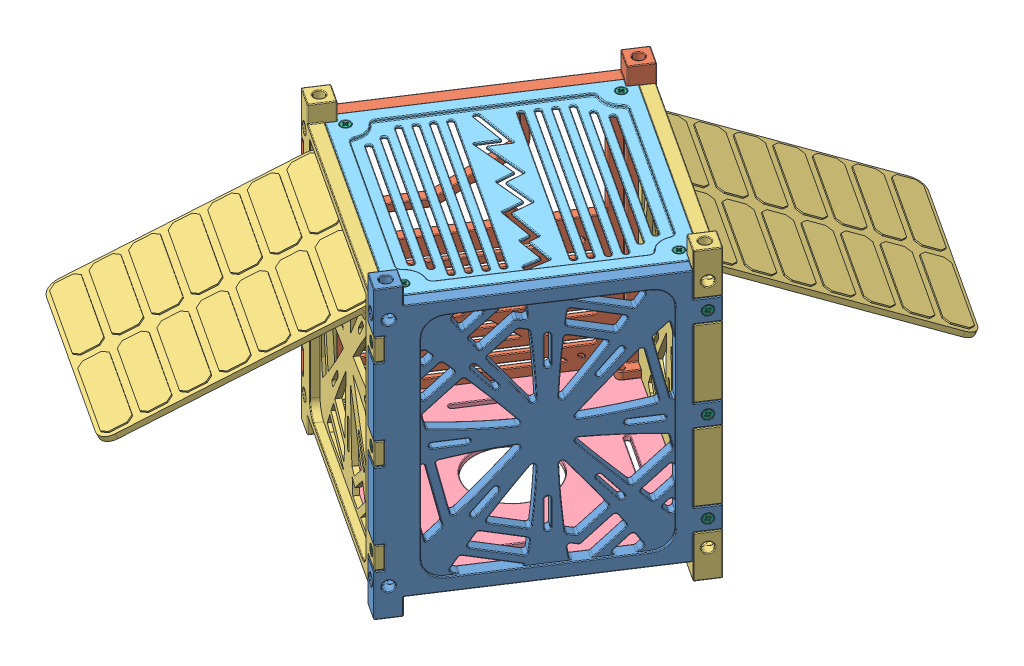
SolidWorks assembly the Kube by hobbes.SLDASM, configuration Default (file format 8000). Lengths in mm.
Overall size (222.09 113.5 266.13).
26 component instances, 6 part files, 35 mates.
Components (placement in the parent):
- Side Artistic-2: Side Artistic.SLDPRT [Default] at (41.6729 12.3251 79.1828) x (0.546944 0 -0.837169) z (0.837169 0 0.546944) size (100 113.5 12.5)
- Side Display Screen-3: Side Display Screen.SLDPRT [Default] at (41.7823 12.3251 79.0154) x (-0.546944 0 0.837169) z (-0.837169 0 -0.546944) size (100 113.5 12.8)
- Side Solar Panel-1: Side Solar Panel.SLDPRT [OPEN panels] at (41.6729 12.3251 79.1828) x (-0.837169 0 -0.546944) z (0.546944 0 -0.837169) size (100 113.5 88.95)
- Side Solar Panel-2: Side Solar Panel.SLDPRT [OPEN panels] at (41.6148 12.3251 78.906) x (0.837169 0 0.546944) z (-0.546944 0 0.837169) size (100 113.5 88.95)
- Top Camera Hole-1: Top Camera Hole.SLDPRT [Default] at (41.6148 12.3251 78.906) x (-0.837169 0 -0.546944) z (-0.546944 0 0.837169) size (90 2 90)
- Top Generic Slots-1: Top Generic Slots.SLDPRT [Default] at (41.6148 12.3251 78.906) x (0.837169 0 0.546944) z (-0.546944 0 0.837169) size (90 2 90)
- Screw-1: Screw.SLDPRT [Default] at (69.651 12.3251 63.7335) size (3.52 1 3.52)
- Screw-5: Screw.SLDPRT [Default] at (135.7873 12.3251 106.9421) size (3.52 1 3.52)
- Screw-7: Screw.SLDPRT [Default] at (92.5787 12.3251 173.0785) size (3.52 1 3.52)
- Screw-9: Screw.SLDPRT [Default] at (26.4424 12.3251 129.8699) size (3.52 1 3.52)
- Screw-11: Screw.SLDPRT [Default] at (84.8234 12.3251 12.7697) x (0.837169 0 0.546944) z (0.546944 0 -0.837169) size (3.52 1 3.52)
- Screw-13: Screw.SLDPRT [Default] at (41.6148 12.3251 78.906) x (0.837169 0 0.546944) z (0.546944 0 -0.837169) size (3.52 1 3.52)
- Screw-15: Screw.SLDPRT [Default] at (107.7512 12.3251 122.1146) x (0.837169 0 0.546944) z (0.546944 0 -0.837169) size (3.52 1 3.52)
- Screw-17: Screw.SLDPRT [Default] at (150.9598 12.3251 55.9782) x (0.837169 0 0.546944) z (0.546944 0 -0.837169) size (3.52 1 3.52)
- Screw-19: Screw.SLDPRT [Default] at (125.6854 36.6112 133.8315) x (0.700852 0.546944 0.457885) z (0.457885 -0.837169 0.299148) size (3.52 1 3.52)
- Screw-21: Screw.SLDPRT [Default] at (125.6854 0.8612 133.8315) x (0.700852 0.546944 0.457885) z (0.457885 -0.837169 0.299148) size (3.52 1 3.52)
- Screw-23: Screw.SLDPRT [Default] at (125.6854 -34.8888 133.8315) x (0.700852 0.546944 0.457885) z (0.457885 -0.837169 0.299148) size (3.52 1 3.52)
- Screw-25: Screw.SLDPRT [Default] at (96.5984 36.6112 -4.8878) x (0.457885 0.546944 -0.700852) z (0.299148 -0.837169 -0.457885) size (3.52 1 3.52)
- Screw-27: Screw.SLDPRT [Default] at (-42.3977 36.6112 24.2574) x (-0.700852 0.546944 -0.457885) z (-0.457885 -0.837169 -0.299148) size (3.52 1 3.52)
- Screw-29: Screw.SLDPRT [Default] at (96.5984 0.8612 -4.8878) x (0.457885 0.546944 -0.700852) z (0.299148 -0.837169 -0.457885) size (3.52 1 3.52)
- Screw-31: Screw.SLDPRT [Default] at (96.5984 -34.8888 -4.8878) x (0.457885 0.546944 -0.700852) z (0.299148 -0.837169 -0.457885) size (3.52 1 3.52)
- Screw-33: Screw.SLDPRT [Default] at (-42.3977 0.8612 24.2574) x (-0.700852 0.546944 -0.457885) z (-0.457885 -0.837169 -0.299148) size (3.52 1 3.52)
- Screw-35: Screw.SLDPRT [Default] at (-42.3977 -34.8888 24.2574) x (-0.700852 0.546944 -0.457885) z (-0.457885 -0.837169 -0.299148) size (3.52 1 3.52)
- Screw-37: Screw.SLDPRT [Default] at (-13.1432 36.6112 163.086) x (-0.457885 0.546944 0.700852) z (-0.299148 -0.837169 0.457885) size (3.52 1 3.52)
- Screw-39: Screw.SLDPRT [Default] at (-13.1432 0.8612 163.086) x (-0.457885 0.546944 0.700852) z (-0.299148 -0.837169 0.457885) size (3.52 1 3.52)
- Screw-41: Screw.SLDPRT [Default] at (-13.1432 -34.8888 163.086) x (-0.457885 0.546944 0.700852) z (-0.299148 -0.837169 0.457885) size (3.52 1 3.52)
Mates (geometry in assembly coordinates):
- Coincident20: coincident anti-aligned: plane of Side Artistic-2 through (102.0437 62.3251 69.0528) normal (0.546944 0 -0.837169); plane of Side Solar Panel-1 through (99.1136 69.0751 67.1385) normal (-0.546944 0 0.837169)
- Coincident21: coincident aligned: plane of Side Artistic-2 through (60.8332 69.0751 141.2726) normal (0.837169 0 0.546944); plane of Side Solar Panel-1 through (106.2295 69.0751 71.7875) normal (0.837169 0 0.546944)
- Coincident23: coincident aligned: plane of Side Artistic-2 through (41.6729 69.0751 79.1828) normal (0 1 0); plane of Side Solar Panel-2 through (41.6148 69.0751 78.906) normal (0 1 0)
- Coincident24: coincident anti-aligned: plane of Side Display Screen-3 through (2.4353 12.3251 53.309) normal (0.837169 0 0.546944); plane of Side Solar Panel-2 through (-20.2629 52.5751 88.0516) normal (-0.837169 0 -0.546944)
- Coincident25: coincident aligned: plane of Side Display Screen-3 through (-24.9119 52.3251 95.1675) normal (-0.546944 0 0.837169); plane of Side Solar Panel-2 through (-20.4749 69.0751 98.0663) normal (-0.546944 0 0.837169)
- Coincident26: coincident aligned: plane of Side Display Screen-3 through (41.7823 62.3251 79.0154) normal (0 1 0); plane of Side Solar Panel-2 through (41.6148 62.3251 78.906) normal (0 1 0)
- Coincident27: coincident anti-aligned: plane of Side Display Screen-3 through (32.6367 -18.9249 17.1377) normal (0.546944 0 -0.837169); plane of Side Solar Panel-1 through (67.3793 12.3251 39.8359) normal (-0.546944 0 0.837169)
- Coincident28: coincident aligned: plane of Side Display Screen-3 through (41.7823 62.3251 79.0154) normal (0 1 0); plane of Side Solar Panel-1 through (41.6729 62.3251 79.1828) normal (0 1 0)
- Coincident29: coincident anti-aligned: plane of Side Display Screen-3 through (29.7379 69.0751 21.5747) normal (0.837169 0 0.546944); plane of Side Solar Panel-1 through (31.5429 62.3251 18.812) normal (-0.837169 0 -0.546944)
- Coincident33: coincident anti-aligned: plane of Side Artistic-2 through (53.1368 -35.6749 133.8553) normal (0 -1 0); plane of Top Camera Hole-1 through (41.6148 -35.6749 78.906) normal (0 1 0)
- Coincident34: coincident anti-aligned: plane of Side Solar Panel-2 through (-15.8259 69.0751 90.9504) normal (0.837169 0 0.546944); plane of Top Camera Hole-1 through (-15.8259 -37.6749 90.9504) normal (-0.837169 0 -0.546944)
- Coincident35: coincident anti-aligned: plane of Side Solar Panel-2 through (-15.8259 69.0751 90.9504) normal (0.546944 0 -0.837169); plane of Top Camera Hole-1 through (-18.756 -37.6749 89.0361) normal (-0.546944 0 0.837169)
- Coincident36: coincident anti-aligned: plane of Side Solar Panel-2 through (-15.8259 69.0751 90.9504) normal (0.546944 0 -0.837169); plane of Top Generic Slots-1 through (-15.8259 62.3251 90.9504) normal (-0.546944 0 0.837169)
- Coincident37: coincident anti-aligned: plane of Side Solar Panel-2 through (-15.8259 69.0751 90.9504) normal (0.837169 0 0.546944); plane of Top Generic Slots-1 through (-17.7402 62.3251 93.8804) normal (-0.837169 0 -0.546944)
- Coincident39: coincident anti-aligned: plane of Side Solar Panel-2 through (-13.0576 60.3251 90.3699) normal (0 1 0); plane of Top Generic Slots-1 through (41.6148 60.3251 78.906) normal (0 -1 0)
- Coincident41: coincident aligned: cone of Top Generic Slots-1 through (30.151 61.3251 24.2335) axis (0 -1 0); cone of Screw-1 through (30.151 62.3251 24.2335) axis (0 -1 0)
- Coincident42: coincident aligned: cone of Top Generic Slots-1 through (96.2873 61.3251 67.4421) axis (0 -1 0); cone of Screw-5 through (96.2873 62.3251 67.4421) axis (0 -1 0)
- Coincident43: coincident aligned: cone of Top Generic Slots-1 through (53.0787 61.3251 133.5785) axis (0 -1 0); cone of Screw-7 through (53.0787 62.3251 133.5785) axis (0 -1 0)
- Coincident44: coincident aligned: cone of Top Generic Slots-1 through (-13.0576 61.3251 90.3699) axis (0 -1 0); cone of Screw-9 through (-13.0576 62.3251 90.3699) axis (0 -1 0)
- Coincident45: coincident aligned: cone of Top Camera Hole-1 through (30.151 -36.6749 24.2335) axis (0 1 0); cone of Screw-11 through (30.151 -37.6749 24.2335) axis (0 1 0)
- Coincident46: coincident aligned: cone of Top Camera Hole-1 through (96.2873 -36.6749 67.4421) axis (0 1 0); cone of Screw-17 through (96.2873 -37.6749 67.4421) axis (0 1 0)
- Coincident47: coincident aligned: cone of Top Camera Hole-1 through (-13.0576 -36.6749 90.3699) axis (0 1 0); cone of Screw-13 through (-13.0576 -37.6749 90.3699) axis (0 1 0)
- Coincident48: coincident aligned: cone of Top Camera Hole-1 through (53.0787 -36.6749 133.5785) axis (0 1 0); cone of Screw-15 through (53.0787 -37.6749 133.5785) axis (0 1 0)
- Coincident49: coincident aligned: cone of Side Solar Panel-2 through (53.1151 48.0751 144.95) axis (0.546944 0 -0.837169); cone of Screw-19 through (52.5681 48.0751 145.7872) axis (0.546944 0 -0.837169)
- Coincident50: coincident aligned: cone of Side Solar Panel-2 through (53.1151 12.3251 144.95) axis (0.546944 0 -0.837169); cone of Screw-21 through (52.5681 12.3251 145.7872) axis (0.546944 0 -0.837169)
- Coincident51: coincident aligned: cone of Side Solar Panel-2 through (53.1151 -23.4249 144.95) axis (0.546944 0 -0.837169); cone of Screw-23 through (52.5681 -23.4249 145.7872) axis (0.546944 0 -0.837169)
- Coincident52: coincident aligned: cone of Side Artistic-2 through (107.7169 48.0751 67.6826) axis (-0.837169 0 -0.546944); cone of Screw-25 through (108.554 48.0751 68.2296) axis (-0.837169 0 -0.546944)
- Coincident53: coincident aligned: cone of Side Artistic-2 through (107.7169 12.3251 67.6826) axis (-0.837169 0 -0.546944); cone of Screw-29 through (108.554 12.3251 68.2296) axis (-0.837169 0 -0.546944)
- Coincident54: coincident aligned: cone of Side Artistic-2 through (107.7169 -23.4249 67.6826) axis (-0.837169 0 -0.546944); cone of Screw-31 through (108.554 -23.4249 68.2296) axis (-0.837169 0 -0.546944)
- Coincident56: coincident aligned: cone of Side Solar Panel-1 through (30.1727 48.0751 13.1389) axis (-0.546944 0 0.837169); cone of Screw-27 through (30.7196 48.0751 12.3017) axis (-0.546944 0 0.837169)
- Coincident57: coincident aligned: cone of Side Solar Panel-1 through (30.1727 -23.4249 13.1389) axis (-0.546944 0 0.837169); cone of Screw-35 through (30.7196 -23.4249 12.3017) axis (-0.546944 0 0.837169)
- Coincident58: coincident aligned: cone of Side Solar Panel-1 through (30.1727 12.3251 13.1389) axis (-0.546944 0 0.837169); cone of Screw-33 through (30.7196 12.3251 12.3017) axis (-0.546944 0 0.837169)
- Coincident59: coincident aligned: cone of Side Display Screen-3 through (-24.2617 48.0751 90.5156) axis (0.837169 0 0.546944); cone of Screw-37 through (-25.0989 48.0751 89.9687) axis (0.837169 0 0.546944)
- Coincident60: coincident aligned: cone of Side Display Screen-3 through (-24.2617 -23.4249 90.5156) axis (0.837169 0 0.546944); cone of Screw-41 through (-25.0989 -23.4249 89.9687) axis (0.837169 0 0.546944)
- Coincident61: coincident aligned: cone of Side Display Screen-3 through (-24.2617 12.3251 90.5156) axis (0.837169 0 0.546944); cone of Screw-39 through (-25.0989 12.3251 89.9687) axis (0.837169 0 0.546944)
